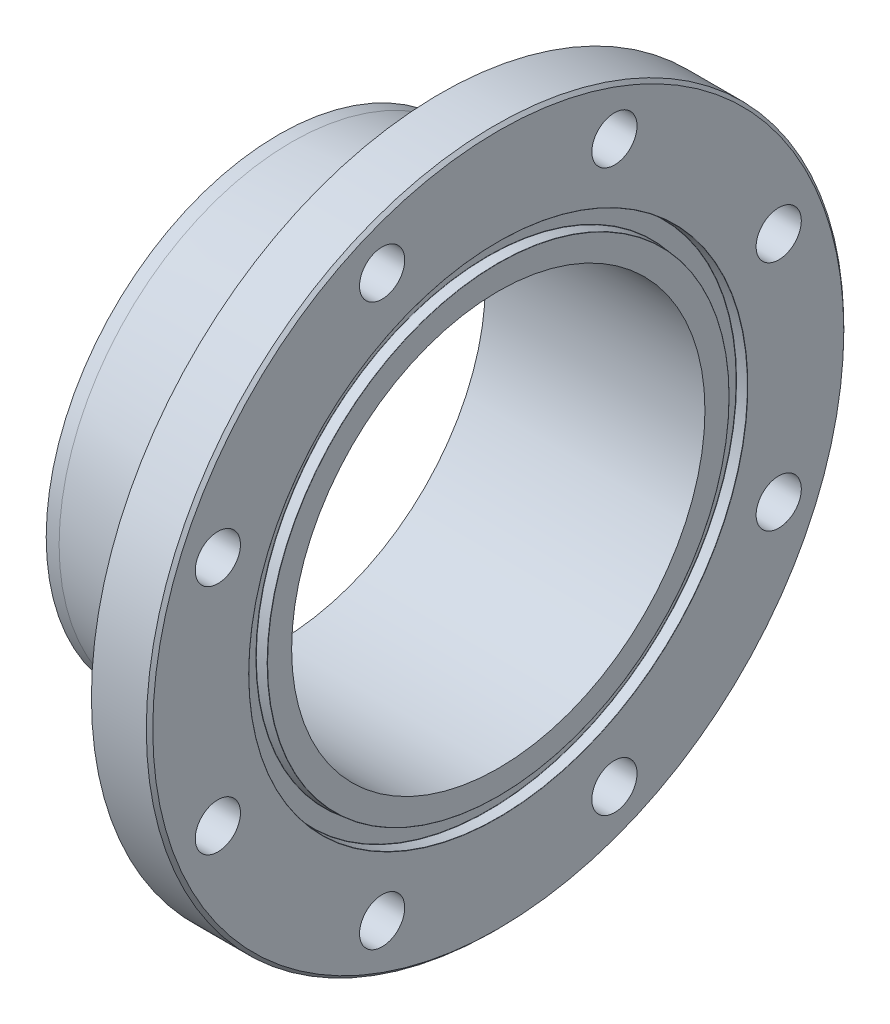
from build123d import *

# Parameters (mm, degrees)
CIRPATTERN1_COUNT = 8
FILLET1_R         = 9.525
CHAMFER1_SIZE     = 1.5875


with BuildPart() as part:
    # Sketch1 → Revolve1 (revolve)
    with BuildSketch(Plane(origin=(0, 0, 0), x_dir=(1, 0, 0), z_dir=(0, 1, 0)), mode=Mode.PRIVATE) as revolve1_sk:
        with BuildLine():
            Line((0, 101.6), (107.95, 101.6))
            Line((107.95, 101.6), (107.95, 113.419461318))
            ThreePointArc((107.95, 113.419461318), (107.916634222, 113.505261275), (107.834068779, 113.545978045))
            Line((107.834068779, 113.545978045), (102.960531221, 113.972357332))
            ThreePointArc((102.960531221, 113.972357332), (102.877965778, 114.013074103), (102.8446, 114.098874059))
            Line((102.8446, 114.098874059), (102.8446, 122.044925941))
            ThreePointArc((102.8446, 122.044925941), (102.877965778, 122.130725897), (102.960531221, 122.171442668))
            Line((102.960531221, 122.171442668), (107.834068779, 122.597821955))
            ThreePointArc((107.834068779, 122.597821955), (107.916634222, 122.638538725), (107.95, 122.724338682))
            Line((107.95, 122.724338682), (107.95, 171.45))
            Line((107.95, 171.45), (79.375, 171.45))
            Line((79.375, 171.45), (79.375, 123.825))
            Line((79.375, 123.825), (6.35, 114.3))
            Line((6.35, 114.3), (0, 114.3))
            Line((0, 114.3), (0, 101.6))
        make_face()
    revolve(revolve1_sk.sketch.rotate(Axis((0, 0, 0), (1, 0, 0)), 180), axis=Axis((0, 0, 0), (1, 0, 0)))

    # Sketch4 → 7_8 _0.875_ Diameter Hole1 (revolve, cut)
    with BuildSketch(Plane(origin=(107.95, 57.105935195, 137.865923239), x_dir=(0, 0, -1), z_dir=(0, 1, 0))):
        Polygon((0, 0), (0, 82.877063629), (11.1125, 76.2), (11.1125, 0), align=None)
    f_7_8_0_875_diameter_hole1 = revolve(axis=Axis((114.3, 57.105935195, 137.865923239), (-1, 0, 0)), mode=Mode.SUBTRACT)

    # CirPattern1: 7_8 _0.875_ Diameter Hole1 ×8 about axis
    cirpattern1_axis = Axis((0, 0, 0), (1, 0, 0))
    for i in range(1, CIRPATTERN1_COUNT):
        add(f_7_8_0_875_diameter_hole1.rotate(cirpattern1_axis, i * 360 / CIRPATTERN1_COUNT), mode=Mode.SUBTRACT)

    # Fillet1
    fillet1_edges = [part.edges().sort_by_distance(p)[0] for p in [
        (79.375, 0, -123.825),
    ]]
    fillet(fillet1_edges, radius=FILLET1_R)

    # Chamfer1
    chamfer1_edges = [part.edges().sort_by_distance(p)[0] for p in [
        (107.95, 0, -171.45),
    ]]
    chamfer(chamfer1_edges, length=CHAMFER1_SIZE)


solid = part.part
